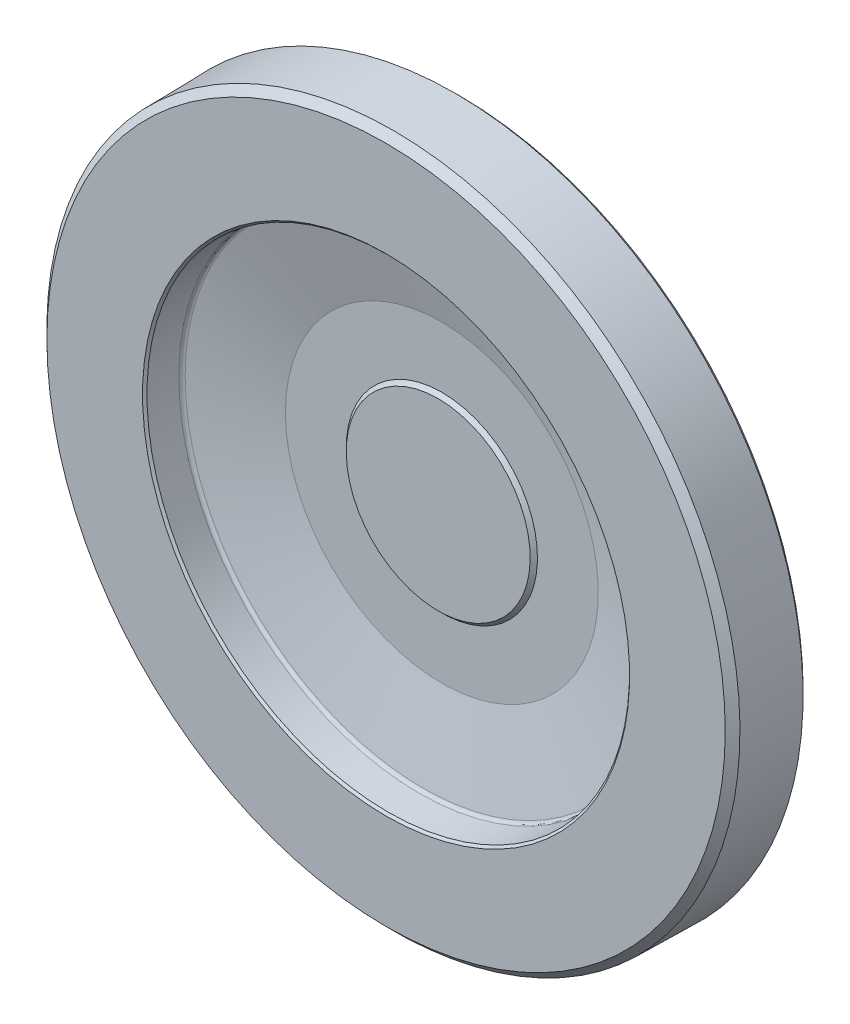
ISO-10303-21;
HEADER;
FILE_DESCRIPTION(('STEP AP214'),'2;1');
FILE_NAME('part.step','',(''),(''),'','','');
FILE_SCHEMA(('AUTOMOTIVE_DESIGN { 1 0 10303 214 1 1 1 1 }'));
ENDSEC;
DATA;
#1=APPLICATION_CONTEXT('core data for automotive mechanical design processes');
#2=APPLICATION_PROTOCOL_DEFINITION('international standard','automotive_design',2000,#1);
#3=PRODUCT_CONTEXT('',#1,'mechanical');
#4=PRODUCT('Part','Part','',(#3));
#5=PRODUCT_RELATED_PRODUCT_CATEGORY('part','',(#4));
#6=PRODUCT_DEFINITION_FORMATION('','',#4);
#7=PRODUCT_DEFINITION_CONTEXT('part definition',#1,'design');
#8=PRODUCT_DEFINITION('design','',#6,#7);
#9=PRODUCT_DEFINITION_SHAPE('','',#8);
#10=(LENGTH_UNIT() NAMED_UNIT(*) SI_UNIT(.MILLI.,.METRE.));
#11=(NAMED_UNIT(*) PLANE_ANGLE_UNIT() SI_UNIT($,.RADIAN.));
#12=(NAMED_UNIT(*) SI_UNIT($,.STERADIAN.) SOLID_ANGLE_UNIT());
#13=UNCERTAINTY_MEASURE_WITH_UNIT(LENGTH_MEASURE(1.E-05),#10,'distance_accuracy_value','');
#14=(GEOMETRIC_REPRESENTATION_CONTEXT(3) GLOBAL_UNCERTAINTY_ASSIGNED_CONTEXT((#13)) GLOBAL_UNIT_ASSIGNED_CONTEXT((#10,
#11,#12)) REPRESENTATION_CONTEXT('',''));
#15=CARTESIAN_POINT('',(0.,0.,0.));
#16=DIRECTION('',(0.,0.,1.));
#17=DIRECTION('',(1.,0.,0.));
#18=AXIS2_PLACEMENT_3D('',#15,#16,#17);
#19=CARTESIAN_POINT('',(0.,0.,43.));
#20=DIRECTION('',(0.,0.,-1.));
#21=DIRECTION('',(0.,1.,0.));
#22=AXIS2_PLACEMENT_3D('',#19,#20,#21);
#23=PLANE('',#22);
#24=CARTESIAN_POINT('',(0.,0.,43.));
#25=DIRECTION('',(0.,0.,-1.));
#26=DIRECTION('',(0.,1.,0.));
#27=AXIS2_PLACEMENT_3D('',#24,#25,#26);
#28=CIRCLE('',#27,26.45);
#29=CARTESIAN_POINT('',(0.,26.45,43.));
#30=VERTEX_POINT('',#29);
#31=EDGE_CURVE('E15',#30,#30,#28,.T.);
#32=ORIENTED_EDGE('',*,*,#31,.F.);
#33=EDGE_LOOP('',(#32));
#34=FACE_BOUND('',#33,.T.);
#35=ADVANCED_FACE('F12',(#34),#23,.F.);
#36=CARTESIAN_POINT('',(0.,0.,41.95));
#37=DIRECTION('',(0.,0.,-1.));
#38=DIRECTION('',(0.,1.,0.));
#39=AXIS2_PLACEMENT_3D('',#36,#37,#38);
#40=CONICAL_SURFACE('',#39,27.5,0.785398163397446);
#41=ORIENTED_EDGE('',*,*,#31,.T.);
#42=EDGE_LOOP('',(#41));
#43=FACE_BOUND('',#42,.T.);
#44=CARTESIAN_POINT('',(0.,0.,41.95));
#45=DIRECTION('',(0.,0.,-1.));
#46=DIRECTION('',(0.,1.,0.));
#47=AXIS2_PLACEMENT_3D('',#44,#45,#46);
#48=CIRCLE('',#47,27.5);
#49=CARTESIAN_POINT('',(0.,27.5,41.95));
#50=VERTEX_POINT('',#49);
#51=EDGE_CURVE('E54',#50,#50,#48,.F.);
#52=ORIENTED_EDGE('',*,*,#51,.T.);
#53=EDGE_LOOP('',(#52));
#54=FACE_BOUND('',#53,.T.);
#55=ADVANCED_FACE('F61',(#43,#54),#40,.T.);
#56=CARTESIAN_POINT('',(19.25,0.,0.));
#57=DIRECTION('',(0.,0.,1.));
#58=DIRECTION('',(0.,-1.,0.));
#59=AXIS2_PLACEMENT_3D('',#56,#57,#58);
#60=PLANE('',#59);
#61=CARTESIAN_POINT('',(0.,0.,0.));
#62=DIRECTION('',(0.,0.,1.));
#63=DIRECTION('',(0.,-1.,0.));
#64=AXIS2_PLACEMENT_3D('',#61,#62,#63);
#65=CIRCLE('',#64,19.25);
#66=CARTESIAN_POINT('',(0.,-19.25,0.));
#67=VERTEX_POINT('',#66);
#68=EDGE_CURVE('E52',#67,#67,#65,.T.);
#69=ORIENTED_EDGE('',*,*,#68,.F.);
#70=EDGE_LOOP('',(#69));
#71=FACE_BOUND('',#70,.T.);
#72=ADVANCED_FACE('F68',(#71),#60,.F.);
#73=CARTESIAN_POINT('',(27.5,0.,41.95));
#74=DIRECTION('',(0.,0.,-1.));
#75=DIRECTION('',(0.,1.,0.));
#76=AXIS2_PLACEMENT_3D('',#73,#74,#75);
#77=PLANE('',#76);
#78=ORIENTED_EDGE('',*,*,#51,.F.);
#79=EDGE_LOOP('',(#78));
#80=FACE_BOUND('',#79,.T.);
#81=CARTESIAN_POINT('',(0.,0.,41.95));
#82=DIRECTION('',(0.,0.,1.));
#83=DIRECTION('',(-1.,0.,0.));
#84=AXIS2_PLACEMENT_3D('',#81,#82,#83);
#85=CIRCLE('',#84,45.);
#86=CARTESIAN_POINT('',(-45.,0.,41.95));
#87=VERTEX_POINT('',#86);
#88=EDGE_CURVE('E48',#87,#87,#85,.T.);
#89=ORIENTED_EDGE('',*,*,#88,.T.);
#90=EDGE_LOOP('',(#89));
#91=FACE_BOUND('',#90,.T.);
#92=ADVANCED_FACE('F159',(#80,#91),#77,.F.);
#93=CARTESIAN_POINT('',(0.,0.,0.75));
#94=DIRECTION('',(0.,0.,1.));
#95=DIRECTION('',(0.,-1.,0.));
#96=AXIS2_PLACEMENT_3D('',#93,#94,#95);
#97=CONICAL_SURFACE('',#96,20.,0.785398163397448);
#98=CARTESIAN_POINT('',(0.,0.,0.75));
#99=DIRECTION('',(0.,0.,1.));
#100=DIRECTION('',(0.,-1.,0.));
#101=AXIS2_PLACEMENT_3D('',#98,#99,#100);
#102=CIRCLE('',#101,20.);
#103=CARTESIAN_POINT('',(0.,-20.,0.75));
#104=VERTEX_POINT('',#103);
#105=EDGE_CURVE('E51',#104,#104,#102,.T.);
#106=ORIENTED_EDGE('',*,*,#105,.F.);
#107=EDGE_LOOP('',(#106));
#108=FACE_BOUND('',#107,.T.);
#109=ORIENTED_EDGE('',*,*,#68,.T.);
#110=EDGE_LOOP('',(#109));
#111=FACE_BOUND('',#110,.T.);
#112=ADVANCED_FACE('F155',(#108,#111),#97,.T.);
#113=CARTESIAN_POINT('',(0.,0.,47.359575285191));
#114=DIRECTION('',(0.,0.,1.));
#115=DIRECTION('',(-1.,0.,0.));
#116=AXIS2_PLACEMENT_3D('',#113,#114,#115);
#117=CONICAL_SURFACE('',#116,68.4314448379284,1.34390352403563);
#118=ORIENTED_EDGE('',*,*,#88,.F.);
#119=EDGE_LOOP('',(#118));
#120=FACE_BOUND('',#119,.T.);
#121=CARTESIAN_POINT('',(0.,0.,47.3595752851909));
#122=DIRECTION('',(0.,0.,-1.));
#123=DIRECTION('',(0.,1.,0.));
#124=AXIS2_PLACEMENT_3D('',#121,#122,#123);
#125=CIRCLE('',#124,68.4314448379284);
#126=CARTESIAN_POINT('',(0.,68.4314448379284,47.3595752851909));
#127=VERTEX_POINT('',#126);
#128=EDGE_CURVE('E47',#127,#127,#125,.F.);
#129=ORIENTED_EDGE('',*,*,#128,.T.);
#130=EDGE_LOOP('',(#129));
#131=FACE_BOUND('',#130,.T.);
#132=ADVANCED_FACE('F158',(#120,#131),#117,.F.);
#133=CARTESIAN_POINT('',(0.,0.,0.));
#134=DIRECTION('',(0.,0.,1.));
#135=DIRECTION('',(0.,-1.,0.));
#136=AXIS2_PLACEMENT_3D('',#133,#134,#135);
#137=CYLINDRICAL_SURFACE('',#136,20.);
#138=CARTESIAN_POINT('',(0.,0.,15.));
#139=DIRECTION('',(0.,0.,1.));
#140=DIRECTION('',(0.,-1.,0.));
#141=AXIS2_PLACEMENT_3D('',#138,#139,#140);
#142=CIRCLE('',#141,20.);
#143=CARTESIAN_POINT('',(0.,-20.,15.));
#144=VERTEX_POINT('',#143);
#145=EDGE_CURVE('E44',#144,#144,#142,.F.);
#146=ORIENTED_EDGE('',*,*,#145,.T.);
#147=EDGE_LOOP('',(#146));
#148=FACE_BOUND('',#147,.T.);
#149=ORIENTED_EDGE('',*,*,#105,.T.);
#150=EDGE_LOOP('',(#149));
#151=FACE_BOUND('',#150,.T.);
#152=ADVANCED_FACE('F140',(#148,#151),#137,.T.);
#153=CARTESIAN_POINT('',(0.,0.,48.3826638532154));
#154=DIRECTION('',(0.,0.,-1.));
#155=DIRECTION('',(0.,1.,0.));
#156=AXIS2_PLACEMENT_3D('',#153,#154,#155);
#157=TOROIDAL_SURFACE('',#156,68.1952462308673,1.05000000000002);
#158=ORIENTED_EDGE('',*,*,#128,.F.);
#159=EDGE_LOOP('',(#158));
#160=FACE_BOUND('',#159,.T.);
#161=CARTESIAN_POINT('',(0.,0.,48.3643388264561));
#162=DIRECTION('',(0.,0.,1.));
#163=DIRECTION('',(0.,-1.,0.));
#164=AXIS2_PLACEMENT_3D('',#161,#162,#163);
#165=CIRCLE('',#164,69.2450863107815);
#166=CARTESIAN_POINT('',(0.,-69.2450863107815,48.3643388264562));
#167=VERTEX_POINT('',#166);
#168=EDGE_CURVE('E43',#167,#167,#165,.T.);
#169=ORIENTED_EDGE('',*,*,#168,.T.);
#170=EDGE_LOOP('',(#169));
#171=FACE_BOUND('',#170,.T.);
#172=ADVANCED_FACE('F135',(#160,#171),#157,.F.);
#173=CARTESIAN_POINT('',(30.,0.,15.));
#174=DIRECTION('',(0.,0.,1.));
#175=DIRECTION('',(0.,-1.,0.));
#176=AXIS2_PLACEMENT_3D('',#173,#174,#175);
#177=PLANE('',#176);
#178=CARTESIAN_POINT('',(0.,0.,15.));
#179=DIRECTION('',(0.,0.,1.));
#180=DIRECTION('',(0.,-1.,0.));
#181=AXIS2_PLACEMENT_3D('',#178,#179,#180);
#182=CIRCLE('',#181,30.);
#183=CARTESIAN_POINT('',(0.,-30.,15.));
#184=VERTEX_POINT('',#183);
#185=EDGE_CURVE('E39',#184,#184,#182,.T.);
#186=ORIENTED_EDGE('',*,*,#185,.F.);
#187=EDGE_LOOP('',(#186));
#188=FACE_BOUND('',#187,.T.);
#189=ORIENTED_EDGE('',*,*,#145,.F.);
#190=EDGE_LOOP('',(#189));
#191=FACE_BOUND('',#190,.T.);
#192=ADVANCED_FACE('F131',(#188,#191),#177,.F.);
#193=CARTESIAN_POINT('',(0.,0.,57.3700959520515));
#194=DIRECTION('',(0.,0.,1.));
#195=DIRECTION('',(0.,-1.,0.));
#196=AXIS2_PLACEMENT_3D('',#193,#194,#195);
#197=CONICAL_SURFACE('',#196,69.4022823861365,0.0174532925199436);
#198=ORIENTED_EDGE('',*,*,#168,.F.);
#199=EDGE_LOOP('',(#198));
#200=FACE_BOUND('',#199,.T.);
#201=CARTESIAN_POINT('',(0.,0.,57.3700959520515));
#202=DIRECTION('',(0.,0.,1.));
#203=DIRECTION('',(0.,-1.,0.));
#204=AXIS2_PLACEMENT_3D('',#201,#202,#203);
#205=CIRCLE('',#204,69.4022823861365);
#206=CARTESIAN_POINT('',(0.,-69.4022823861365,57.3700959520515));
#207=VERTEX_POINT('',#206);
#208=EDGE_CURVE('E42',#207,#207,#205,.T.);
#209=ORIENTED_EDGE('',*,*,#208,.T.);
#210=EDGE_LOOP('',(#209));
#211=FACE_BOUND('',#210,.T.);
#212=ADVANCED_FACE('F127',(#200,#211),#197,.F.);
#213=CARTESIAN_POINT('',(0.,0.,0.));
#214=DIRECTION('',(0.,0.,1.));
#215=DIRECTION('',(0.,-1.,0.));
#216=AXIS2_PLACEMENT_3D('',#213,#214,#215);
#217=CYLINDRICAL_SURFACE('',#216,30.);
#218=CARTESIAN_POINT('',(0.,0.,25.7507319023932));
#219=DIRECTION('',(0.,0.,-1.));
#220=DIRECTION('',(0.,1.,0.));
#221=AXIS2_PLACEMENT_3D('',#218,#219,#220);
#222=CIRCLE('',#221,30.);
#223=CARTESIAN_POINT('',(0.,30.,25.7507319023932));
#224=VERTEX_POINT('',#223);
#225=EDGE_CURVE('E38',#224,#224,#222,.T.);
#226=ORIENTED_EDGE('',*,*,#225,.T.);
#227=EDGE_LOOP('',(#226));
#228=FACE_BOUND('',#227,.T.);
#229=ORIENTED_EDGE('',*,*,#185,.T.);
#230=EDGE_LOOP('',(#229));
#231=FACE_BOUND('',#230,.T.);
#232=ADVANCED_FACE('F123',(#228,#231),#217,.T.);
#233=CARTESIAN_POINT('',(0.,0.,58.));
#234=DIRECTION('',(0.,0.,1.));
#235=DIRECTION('',(0.,-1.,0.));
#236=AXIS2_PLACEMENT_3D('',#233,#234,#235);
#237=CONICAL_SURFACE('',#236,70.043277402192,0.794124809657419);
#238=ORIENTED_EDGE('',*,*,#208,.F.);
#239=EDGE_LOOP('',(#238));
#240=FACE_BOUND('',#239,.T.);
#241=CARTESIAN_POINT('',(0.,0.,58.));
#242=DIRECTION('',(0.,0.,1.));
#243=DIRECTION('',(0.,-1.,0.));
#244=AXIS2_PLACEMENT_3D('',#241,#242,#243);
#245=CIRCLE('',#244,70.043277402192);
#246=CARTESIAN_POINT('',(0.,-70.043277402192,58.));
#247=VERTEX_POINT('',#246);
#248=EDGE_CURVE('E35',#247,#247,#245,.T.);
#249=ORIENTED_EDGE('',*,*,#248,.T.);
#250=EDGE_LOOP('',(#249));
#251=FACE_BOUND('',#250,.T.);
#252=ADVANCED_FACE('F119',(#240,#251),#237,.F.);
#253=CARTESIAN_POINT('',(0.,0.,25.7507319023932));
#254=DIRECTION('',(0.,0.,-1.));
#255=DIRECTION('',(0.,1.,0.));
#256=AXIS2_PLACEMENT_3D('',#253,#254,#255);
#257=TOROIDAL_SURFACE('',#256,32.1,2.1);
#258=CARTESIAN_POINT('',(0.,0.,27.7240864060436));
#259=DIRECTION('',(0.,0.,1.));
#260=DIRECTION('',(0.,-1.,0.));
#261=AXIS2_PLACEMENT_3D('',#258,#259,#260);
#262=CIRCLE('',#261,31.3817576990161);
#263=CARTESIAN_POINT('',(0.,-31.3817576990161,27.7240864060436));
#264=VERTEX_POINT('',#263);
#265=EDGE_CURVE('E34',#264,#264,#262,.T.);
#266=ORIENTED_EDGE('',*,*,#265,.F.);
#267=EDGE_LOOP('',(#266));
#268=FACE_BOUND('',#267,.T.);
#269=ORIENTED_EDGE('',*,*,#225,.F.);
#270=EDGE_LOOP('',(#269));
#271=FACE_BOUND('',#270,.T.);
#272=ADVANCED_FACE('F114',(#268,#271),#257,.F.);
#273=CARTESIAN_POINT('',(70.043277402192,0.,58.));
#274=DIRECTION('',(0.,0.,-1.));
#275=DIRECTION('',(0.,1.,0.));
#276=AXIS2_PLACEMENT_3D('',#273,#274,#275);
#277=PLANE('',#276);
#278=ORIENTED_EDGE('',*,*,#248,.F.);
#279=EDGE_LOOP('',(#278));
#280=FACE_BOUND('',#279,.T.);
#281=CARTESIAN_POINT('',(0.,0.,58.));
#282=DIRECTION('',(0.,0.,-1.));
#283=DIRECTION('',(0.,1.,0.));
#284=AXIS2_PLACEMENT_3D('',#281,#282,#283);
#285=CIRCLE('',#284,97.5517714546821);
#286=CARTESIAN_POINT('',(0.,97.5517714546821,58.));
#287=VERTEX_POINT('',#286);
#288=EDGE_CURVE('E30',#287,#287,#285,.T.);
#289=ORIENTED_EDGE('',*,*,#288,.F.);
#290=EDGE_LOOP('',(#289));
#291=FACE_BOUND('',#290,.T.);
#292=ADVANCED_FACE('F118',(#280,#291),#277,.F.);
#293=CARTESIAN_POINT('',(0.,0.,40.987121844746));
#294=DIRECTION('',(0.,0.,1.));
#295=DIRECTION('',(0.,-1.,0.));
#296=AXIS2_PLACEMENT_3D('',#293,#294,#295);
#297=CONICAL_SURFACE('',#296,67.8216480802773,1.22173047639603);
#298=CARTESIAN_POINT('',(0.,0.,40.987121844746));
#299=DIRECTION('',(0.,0.,-1.));
#300=DIRECTION('',(0.,1.,0.));
#301=AXIS2_PLACEMENT_3D('',#298,#299,#300);
#302=CIRCLE('',#301,67.8216480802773);
#303=CARTESIAN_POINT('',(0.,67.8216480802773,40.987121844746));
#304=VERTEX_POINT('',#303);
#305=EDGE_CURVE('E33',#304,#304,#302,.T.);
#306=ORIENTED_EDGE('',*,*,#305,.T.);
#307=EDGE_LOOP('',(#306));
#308=FACE_BOUND('',#307,.T.);
#309=ORIENTED_EDGE('',*,*,#265,.T.);
#310=EDGE_LOOP('',(#309));
#311=FACE_BOUND('',#310,.T.);
#312=ADVANCED_FACE('F201',(#308,#311),#297,.T.);
#313=CARTESIAN_POINT('',(0.,0.,55.9003198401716));
#314=DIRECTION('',(0.,0.,-1.));
#315=DIRECTION('',(0.,1.,0.));
#316=AXIS2_PLACEMENT_3D('',#313,#314,#315);
#317=CONICAL_SURFACE('',#316,99.6884215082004,0.79412480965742);
#318=ORIENTED_EDGE('',*,*,#288,.T.);
#319=EDGE_LOOP('',(#318));
#320=FACE_BOUND('',#319,.T.);
#321=CARTESIAN_POINT('',(0.,0.,55.9003198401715));
#322=DIRECTION('',(0.,0.,-1.));
#323=DIRECTION('',(0.,1.,0.));
#324=AXIS2_PLACEMENT_3D('',#321,#322,#323);
#325=CIRCLE('',#324,99.6884215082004);
#326=CARTESIAN_POINT('',(0.,99.6884215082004,55.9003198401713));
#327=VERTEX_POINT('',#326);
#328=EDGE_CURVE('E103',#327,#327,#325,.T.);
#329=ORIENTED_EDGE('',*,*,#328,.F.);
#330=EDGE_LOOP('',(#329));
#331=FACE_BOUND('',#330,.T.);
#332=ADVANCED_FACE('F93',(#320,#331),#317,.T.);
#333=CARTESIAN_POINT('',(0.,0.,40.0004445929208));
#334=DIRECTION('',(0.,0.,-1.));
#335=DIRECTION('',(0.,1.,0.));
#336=AXIS2_PLACEMENT_3D('',#333,#334,#335);
#337=TOROIDAL_SURFACE('',#336,68.1807692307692,1.05);
#338=CARTESIAN_POINT('',(0.,0.,40.0004445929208));
#339=DIRECTION('',(0.,0.,1.));
#340=DIRECTION('',(0.,-1.,0.));
#341=AXIS2_PLACEMENT_3D('',#338,#339,#340);
#342=CIRCLE('',#341,69.2307692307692);
#343=CARTESIAN_POINT('',(0.,-69.2307692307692,40.0004445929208));
#344=VERTEX_POINT('',#343);
#345=EDGE_CURVE('E208',#344,#344,#342,.F.);
#346=ORIENTED_EDGE('',*,*,#345,.T.);
#347=EDGE_LOOP('',(#346));
#348=FACE_BOUND('',#347,.T.);
#349=ORIENTED_EDGE('',*,*,#305,.F.);
#350=EDGE_LOOP('',(#349));
#351=FACE_BOUND('',#350,.T.);
#352=ADVANCED_FACE('F88',(#348,#351),#337,.F.);
#353=CARTESIAN_POINT('',(0.,0.,38.0498400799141));
#354=DIRECTION('',(0.,0.,-1.));
#355=DIRECTION('',(0.,1.,0.));
#356=AXIS2_PLACEMENT_3D('',#353,#354,#355);
#357=CONICAL_SURFACE('',#356,100.000002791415,0.0174532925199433);
#358=ORIENTED_EDGE('',*,*,#328,.T.);
#359=EDGE_LOOP('',(#358));
#360=FACE_BOUND('',#359,.T.);
#361=CARTESIAN_POINT('',(0.,0.,38.0498400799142));
#362=DIRECTION('',(0.,0.,1.));
#363=DIRECTION('',(0.,-1.,0.));
#364=AXIS2_PLACEMENT_3D('',#361,#362,#363);
#365=CIRCLE('',#364,100.000002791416);
#366=CARTESIAN_POINT('',(0.,-100.000002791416,38.0498400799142));
#367=VERTEX_POINT('',#366);
#368=EDGE_CURVE('E24',#367,#367,#365,.F.);
#369=ORIENTED_EDGE('',*,*,#368,.F.);
#370=EDGE_LOOP('',(#369));
#371=FACE_BOUND('',#370,.T.);
#372=ADVANCED_FACE('F84',(#360,#371),#357,.T.);
#373=CARTESIAN_POINT('',(0.,0.,0.));
#374=DIRECTION('',(0.,0.,1.));
#375=DIRECTION('',(0.,-1.,0.));
#376=AXIS2_PLACEMENT_3D('',#373,#374,#375);
#377=CYLINDRICAL_SURFACE('',#376,69.2307692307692);
#378=CARTESIAN_POINT('',(0.,0.,37.));
#379=DIRECTION('',(0.,0.,1.));
#380=DIRECTION('',(0.,-1.,0.));
#381=AXIS2_PLACEMENT_3D('',#378,#379,#380);
#382=CIRCLE('',#381,69.2307692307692);
#383=CARTESIAN_POINT('',(0.,-69.2307692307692,37.));
#384=VERTEX_POINT('',#383);
#385=EDGE_CURVE('E19',#384,#384,#382,.F.);
#386=ORIENTED_EDGE('',*,*,#385,.T.);
#387=EDGE_LOOP('',(#386));
#388=FACE_BOUND('',#387,.T.);
#389=ORIENTED_EDGE('',*,*,#345,.F.);
#390=EDGE_LOOP('',(#389));
#391=FACE_BOUND('',#390,.T.);
#392=ADVANCED_FACE('F77',(#388,#391),#377,.F.);
#393=CARTESIAN_POINT('',(0.,0.,38.0498400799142));
#394=DIRECTION('',(0.,0.,1.));
#395=DIRECTION('',(-1.,0.,0.));
#396=AXIS2_PLACEMENT_3D('',#393,#394,#395);
#397=CONICAL_SURFACE('',#396,100.000002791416,0.776671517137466);
#398=ORIENTED_EDGE('',*,*,#368,.T.);
#399=EDGE_LOOP('',(#398));
#400=FACE_BOUND('',#399,.T.);
#401=CARTESIAN_POINT('',(0.,0.,37.));
#402=DIRECTION('',(0.,0.,1.));
#403=DIRECTION('',(-1.,0.,0.));
#404=AXIS2_PLACEMENT_3D('',#401,#402,#403);
#405=CIRCLE('',#404,98.9683278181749);
#406=CARTESIAN_POINT('',(-98.9683278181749,0.,37.));
#407=VERTEX_POINT('',#406);
#408=EDGE_CURVE('E8',#407,#407,#405,.T.);
#409=ORIENTED_EDGE('',*,*,#408,.T.);
#410=EDGE_LOOP('',(#409));
#411=FACE_BOUND('',#410,.T.);
#412=ADVANCED_FACE('F71',(#400,#411),#397,.T.);
#413=CARTESIAN_POINT('',(98.9683278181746,0.,37.));
#414=DIRECTION('',(0.,0.,1.));
#415=DIRECTION('',(0.,-1.,0.));
#416=AXIS2_PLACEMENT_3D('',#413,#414,#415);
#417=PLANE('',#416);
#418=ORIENTED_EDGE('',*,*,#408,.F.);
#419=EDGE_LOOP('',(#418));
#420=FACE_BOUND('',#419,.T.);
#421=ORIENTED_EDGE('',*,*,#385,.F.);
#422=EDGE_LOOP('',(#421));
#423=FACE_BOUND('',#422,.T.);
#424=ADVANCED_FACE('F69',(#420,#423),#417,.F.);
#425=CLOSED_SHELL('',(#35,#55,#72,#92,#112,#132,#152,#172,#192,#212,#232,#252,#272,#292,#312,
#332,#352,#372,#392,#412,#424));
#426=MANIFOLD_SOLID_BREP('B1',#425);
#427=ADVANCED_BREP_SHAPE_REPRESENTATION('',(#18,#426),#14);
#428=SHAPE_DEFINITION_REPRESENTATION(#9,#427);
ENDSEC;
END-ISO-10303-21;
